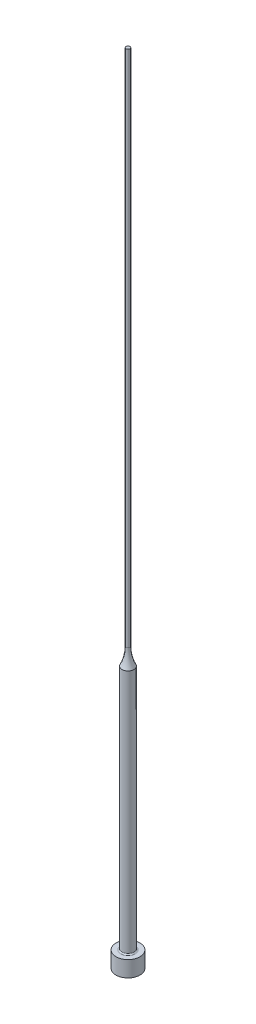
ISO-10303-21;
HEADER;
FILE_DESCRIPTION(('STEP AP214'),'2;1');
FILE_NAME('part.step','',(''),(''),'','','');
FILE_SCHEMA(('AUTOMOTIVE_DESIGN { 1 0 10303 214 1 1 1 1 }'));
ENDSEC;
DATA;
#1=APPLICATION_CONTEXT('core data for automotive mechanical design processes');
#2=APPLICATION_PROTOCOL_DEFINITION('international standard','automotive_design',2000,#1);
#3=PRODUCT_CONTEXT('',#1,'mechanical');
#4=PRODUCT('Part','Part','',(#3));
#5=PRODUCT_RELATED_PRODUCT_CATEGORY('part','',(#4));
#6=PRODUCT_DEFINITION_FORMATION('','',#4);
#7=PRODUCT_DEFINITION_CONTEXT('part definition',#1,'design');
#8=PRODUCT_DEFINITION('design','',#6,#7);
#9=PRODUCT_DEFINITION_SHAPE('','',#8);
#10=(LENGTH_UNIT() NAMED_UNIT(*) SI_UNIT(.MILLI.,.METRE.));
#11=(NAMED_UNIT(*) PLANE_ANGLE_UNIT() SI_UNIT($,.RADIAN.));
#12=(NAMED_UNIT(*) SI_UNIT($,.STERADIAN.) SOLID_ANGLE_UNIT());
#13=UNCERTAINTY_MEASURE_WITH_UNIT(LENGTH_MEASURE(1.E-05),#10,'distance_accuracy_value','');
#14=(GEOMETRIC_REPRESENTATION_CONTEXT(3) GLOBAL_UNCERTAINTY_ASSIGNED_CONTEXT((#13)) GLOBAL_UNIT_ASSIGNED_CONTEXT((#10,
#11,#12)) REPRESENTATION_CONTEXT('',''));
#15=CARTESIAN_POINT('',(0.,0.,0.));
#16=DIRECTION('',(0.,0.,1.));
#17=DIRECTION('',(1.,0.,0.));
#18=AXIS2_PLACEMENT_3D('',#15,#16,#17);
#19=CARTESIAN_POINT('',(0.500000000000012,200.,0.));
#20=DIRECTION('',(0.,-1.,0.));
#21=DIRECTION('',(1.,0.,0.));
#22=AXIS2_PLACEMENT_3D('',#19,#20,#21);
#23=PLANE('',#22);
#24=CARTESIAN_POINT('',(0.,200.,0.));
#25=DIRECTION('',(0.,1.,0.));
#26=DIRECTION('',(-1.,0.,0.));
#27=AXIS2_PLACEMENT_3D('',#24,#25,#26);
#28=CIRCLE('',#27,0.500000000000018);
#29=CARTESIAN_POINT('',(-0.500000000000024,200.,0.));
#30=VERTEX_POINT('',#29);
#31=EDGE_CURVE('E10',#30,#30,#28,.T.);
#32=ORIENTED_EDGE('',*,*,#31,.T.);
#33=EDGE_LOOP('',(#32));
#34=FACE_BOUND('',#33,.T.);
#35=ADVANCED_FACE('F30',(#34),#23,.F.);
#36=CARTESIAN_POINT('',(0.,200.,0.));
#37=DIRECTION('',(0.,1.,0.));
#38=DIRECTION('',(-1.,0.,0.));
#39=AXIS2_PLACEMENT_3D('',#36,#37,#38);
#40=CYLINDRICAL_SURFACE('',#39,0.500000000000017);
#41=ORIENTED_EDGE('',*,*,#31,.F.);
#42=EDGE_LOOP('',(#41));
#43=FACE_BOUND('',#42,.T.);
#44=CARTESIAN_POINT('',(0.,70.,0.));
#45=DIRECTION('',(0.,1.,0.));
#46=DIRECTION('',(-1.,0.,0.));
#47=AXIS2_PLACEMENT_3D('',#44,#45,#46);
#48=CIRCLE('',#47,0.500000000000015);
#49=CARTESIAN_POINT('',(-0.500000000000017,70.,0.));
#50=VERTEX_POINT('',#49);
#51=EDGE_CURVE('E36',#50,#50,#48,.T.);
#52=ORIENTED_EDGE('',*,*,#51,.T.);
#53=EDGE_LOOP('',(#52));
#54=FACE_BOUND('',#53,.T.);
#55=ADVANCED_FACE('F71',(#43,#54),#40,.T.);
#56=CARTESIAN_POINT('',(0.,70.,0.));
#57=DIRECTION('',(0.,1.,0.));
#58=DIRECTION('',(-1.,0.,0.));
#59=AXIS2_PLACEMENT_3D('',#56,#57,#58);
#60=TOROIDAL_SURFACE('',#59,10.5,10.);
#61=ORIENTED_EDGE('',*,*,#51,.F.);
#62=EDGE_LOOP('',(#61));
#63=FACE_BOUND('',#62,.T.);
#64=CARTESIAN_POINT('',(0.,65.6411010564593,0.));
#65=DIRECTION('',(0.,1.,0.));
#66=DIRECTION('',(-1.,0.,0.));
#67=AXIS2_PLACEMENT_3D('',#64,#65,#66);
#68=CIRCLE('',#67,1.50000000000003);
#69=CARTESIAN_POINT('',(-1.50000000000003,65.6411010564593,0.));
#70=VERTEX_POINT('',#69);
#71=EDGE_CURVE('E40',#70,#70,#68,.T.);
#72=ORIENTED_EDGE('',*,*,#71,.T.);
#73=EDGE_LOOP('',(#72));
#74=FACE_BOUND('',#73,.T.);
#75=ADVANCED_FACE('F75',(#63,#74),#60,.F.);
#76=CARTESIAN_POINT('',(0.,200.,0.));
#77=DIRECTION('',(0.,1.,0.));
#78=DIRECTION('',(-1.,0.,0.));
#79=AXIS2_PLACEMENT_3D('',#76,#77,#78);
#80=CYLINDRICAL_SURFACE('',#79,1.50000000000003);
#81=ORIENTED_EDGE('',*,*,#71,.F.);
#82=EDGE_LOOP('',(#81));
#83=FACE_BOUND('',#82,.T.);
#84=CARTESIAN_POINT('',(0.,4.3,0.));
#85=DIRECTION('',(0.,1.,0.));
#86=DIRECTION('',(-1.,0.,0.));
#87=AXIS2_PLACEMENT_3D('',#84,#85,#86);
#88=CIRCLE('',#87,1.50000000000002);
#89=CARTESIAN_POINT('',(-1.50000000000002,4.3,0.));
#90=VERTEX_POINT('',#89);
#91=EDGE_CURVE('E44',#90,#90,#88,.T.);
#92=ORIENTED_EDGE('',*,*,#91,.T.);
#93=EDGE_LOOP('',(#92));
#94=FACE_BOUND('',#93,.T.);
#95=ADVANCED_FACE('F80',(#83,#94),#80,.T.);
#96=CARTESIAN_POINT('',(0.,4.3,0.));
#97=DIRECTION('',(0.,1.,0.));
#98=DIRECTION('',(-1.,0.,0.));
#99=AXIS2_PLACEMENT_3D('',#96,#97,#98);
#100=TOROIDAL_SURFACE('',#99,1.80000000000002,0.3);
#101=ORIENTED_EDGE('',*,*,#91,.F.);
#102=EDGE_LOOP('',(#101));
#103=FACE_BOUND('',#102,.T.);
#104=CARTESIAN_POINT('',(0.,4.,0.));
#105=DIRECTION('',(0.,1.,0.));
#106=DIRECTION('',(-1.,0.,0.));
#107=AXIS2_PLACEMENT_3D('',#104,#105,#106);
#108=CIRCLE('',#107,1.80000000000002);
#109=CARTESIAN_POINT('',(-1.80000000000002,4.,0.));
#110=VERTEX_POINT('',#109);
#111=EDGE_CURVE('E49',#110,#110,#108,.T.);
#112=ORIENTED_EDGE('',*,*,#111,.T.);
#113=EDGE_LOOP('',(#112));
#114=FACE_BOUND('',#113,.T.);
#115=ADVANCED_FACE('F86',(#103,#114),#100,.F.);
#116=CARTESIAN_POINT('',(3.00000000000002,4.,0.));
#117=DIRECTION('',(0.,-1.,0.));
#118=DIRECTION('',(1.,0.,0.));
#119=AXIS2_PLACEMENT_3D('',#116,#117,#118);
#120=PLANE('',#119);
#121=ORIENTED_EDGE('',*,*,#111,.F.);
#122=EDGE_LOOP('',(#121));
#123=FACE_BOUND('',#122,.T.);
#124=CARTESIAN_POINT('',(0.,4.,0.));
#125=DIRECTION('',(0.,1.,0.));
#126=DIRECTION('',(-1.,0.,0.));
#127=AXIS2_PLACEMENT_3D('',#124,#125,#126);
#128=CIRCLE('',#127,3.00000000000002);
#129=CARTESIAN_POINT('',(-3.00000000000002,4.,0.));
#130=VERTEX_POINT('',#129);
#131=EDGE_CURVE('E52',#130,#130,#128,.T.);
#132=ORIENTED_EDGE('',*,*,#131,.T.);
#133=EDGE_LOOP('',(#132));
#134=FACE_BOUND('',#133,.T.);
#135=ADVANCED_FACE('F67',(#123,#134),#120,.F.);
#136=CARTESIAN_POINT('',(0.,200.,0.));
#137=DIRECTION('',(0.,1.,0.));
#138=DIRECTION('',(-1.,0.,0.));
#139=AXIS2_PLACEMENT_3D('',#136,#137,#138);
#140=CYLINDRICAL_SURFACE('',#139,3.00000000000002);
#141=ORIENTED_EDGE('',*,*,#131,.F.);
#142=EDGE_LOOP('',(#141));
#143=FACE_BOUND('',#142,.T.);
#144=CARTESIAN_POINT('',(0.,0.,0.));
#145=DIRECTION('',(0.,1.,0.));
#146=DIRECTION('',(-1.,0.,0.));
#147=AXIS2_PLACEMENT_3D('',#144,#145,#146);
#148=CIRCLE('',#147,3.00000000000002);
#149=CARTESIAN_POINT('',(-3.00000000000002,0.,0.));
#150=VERTEX_POINT('',#149);
#151=EDGE_CURVE('E55',#150,#150,#148,.T.);
#152=ORIENTED_EDGE('',*,*,#151,.T.);
#153=EDGE_LOOP('',(#152));
#154=FACE_BOUND('',#153,.T.);
#155=ADVANCED_FACE('F59',(#143,#154),#140,.T.);
#156=CARTESIAN_POINT('',(0.,0.,0.));
#157=DIRECTION('',(0.,1.,0.));
#158=DIRECTION('',(-1.,0.,0.));
#159=AXIS2_PLACEMENT_3D('',#156,#157,#158);
#160=PLANE('',#159);
#161=ORIENTED_EDGE('',*,*,#151,.F.);
#162=EDGE_LOOP('',(#161));
#163=FACE_BOUND('',#162,.T.);
#164=ADVANCED_FACE('F61',(#163),#160,.F.);
#165=CLOSED_SHELL('',(#35,#55,#75,#95,#115,#135,#155,#164));
#166=MANIFOLD_SOLID_BREP('B2',#165);
#167=ADVANCED_BREP_SHAPE_REPRESENTATION('',(#18,#166),#14);
#168=SHAPE_DEFINITION_REPRESENTATION(#9,#167);
ENDSEC;
END-ISO-10303-21;
